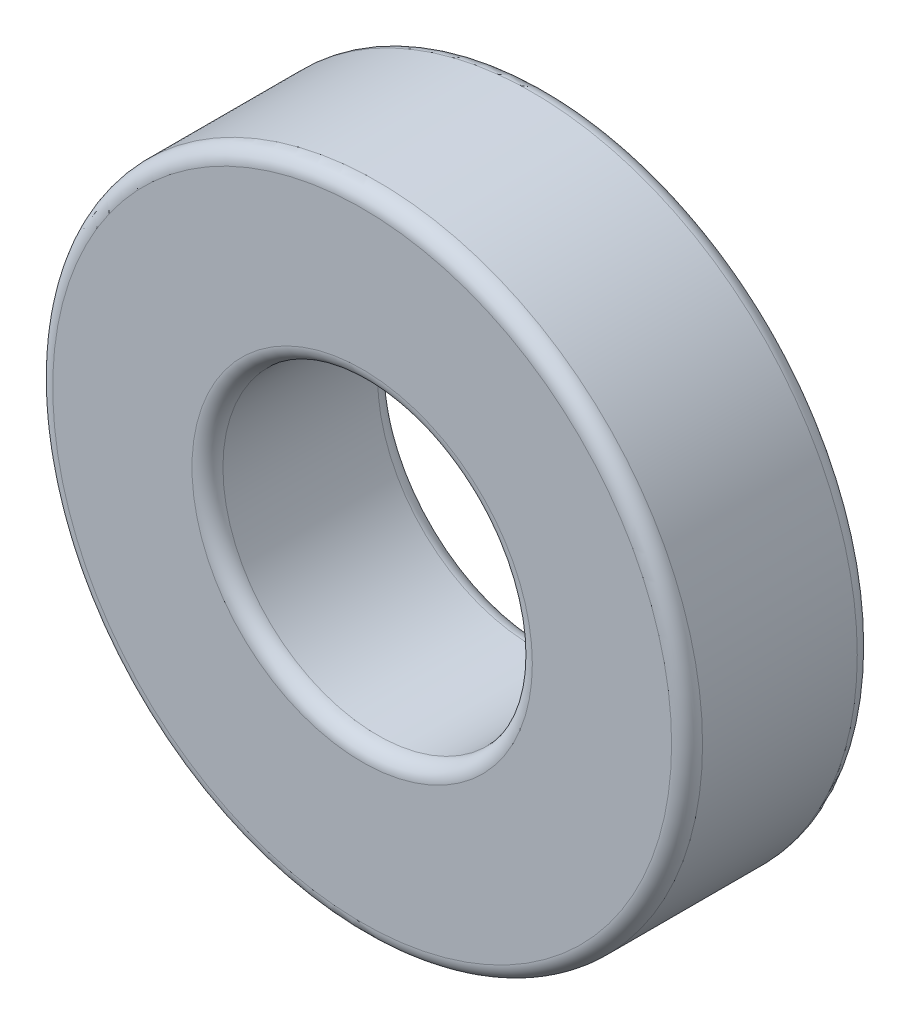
ISO-10303-21;
HEADER;
FILE_DESCRIPTION(('STEP AP214'),'2;1');
FILE_NAME('part.step','',(''),(''),'','','');
FILE_SCHEMA(('AUTOMOTIVE_DESIGN { 1 0 10303 214 1 1 1 1 }'));
ENDSEC;
DATA;
#1=APPLICATION_CONTEXT('core data for automotive mechanical design processes');
#2=APPLICATION_PROTOCOL_DEFINITION('international standard','automotive_design',2000,#1);
#3=PRODUCT_CONTEXT('',#1,'mechanical');
#4=PRODUCT('Part','Part','',(#3));
#5=PRODUCT_RELATED_PRODUCT_CATEGORY('part','',(#4));
#6=PRODUCT_DEFINITION_FORMATION('','',#4);
#7=PRODUCT_DEFINITION_CONTEXT('part definition',#1,'design');
#8=PRODUCT_DEFINITION('design','',#6,#7);
#9=PRODUCT_DEFINITION_SHAPE('','',#8);
#10=(LENGTH_UNIT() NAMED_UNIT(*) SI_UNIT(.MILLI.,.METRE.));
#11=(NAMED_UNIT(*) PLANE_ANGLE_UNIT() SI_UNIT($,.RADIAN.));
#12=(NAMED_UNIT(*) SI_UNIT($,.STERADIAN.) SOLID_ANGLE_UNIT());
#13=UNCERTAINTY_MEASURE_WITH_UNIT(LENGTH_MEASURE(1.E-05),#10,'distance_accuracy_value','');
#14=(GEOMETRIC_REPRESENTATION_CONTEXT(3) GLOBAL_UNCERTAINTY_ASSIGNED_CONTEXT((#13)) GLOBAL_UNIT_ASSIGNED_CONTEXT((#10,
#11,#12)) REPRESENTATION_CONTEXT('',''));
#15=CARTESIAN_POINT('',(0.,0.,0.));
#16=DIRECTION('',(0.,0.,1.));
#17=DIRECTION('',(1.,0.,0.));
#18=AXIS2_PLACEMENT_3D('',#15,#16,#17);
#19=CARTESIAN_POINT('',(0.,0.,12.));
#20=DIRECTION('',(0.,0.,1.));
#21=DIRECTION('',(1.,0.,0.));
#22=AXIS2_PLACEMENT_3D('',#19,#20,#21);
#23=PLANE('',#22);
#24=CARTESIAN_POINT('',(0.,0.,12.));
#25=DIRECTION('',(0.,0.,1.));
#26=DIRECTION('',(1.,0.,0.));
#27=AXIS2_PLACEMENT_3D('',#24,#25,#26);
#28=CIRCLE('',#27,11.);
#29=CARTESIAN_POINT('',(11.,0.,12.));
#30=VERTEX_POINT('',#29);
#31=EDGE_CURVE('E10',#30,#30,#28,.F.);
#32=ORIENTED_EDGE('',*,*,#31,.T.);
#33=EDGE_LOOP('',(#32));
#34=FACE_BOUND('',#33,.T.);
#35=CARTESIAN_POINT('',(0.,0.,12.));
#36=DIRECTION('',(0.,0.,1.));
#37=DIRECTION('',(1.,0.,0.));
#38=AXIS2_PLACEMENT_3D('',#35,#36,#37);
#39=CIRCLE('',#38,20.);
#40=CARTESIAN_POINT('',(20.,0.,12.));
#41=VERTEX_POINT('',#40);
#42=EDGE_CURVE('E38',#41,#41,#39,.T.);
#43=ORIENTED_EDGE('',*,*,#42,.T.);
#44=EDGE_LOOP('',(#43));
#45=FACE_BOUND('',#44,.T.);
#46=ADVANCED_FACE('F31',(#34,#45),#23,.T.);
#47=CARTESIAN_POINT('',(0.,0.,0.));
#48=DIRECTION('',(0.,0.,1.));
#49=DIRECTION('',(1.,0.,0.));
#50=AXIS2_PLACEMENT_3D('',#47,#48,#49);
#51=PLANE('',#50);
#52=CARTESIAN_POINT('',(0.,0.,0.));
#53=DIRECTION('',(0.,0.,1.));
#54=DIRECTION('',(1.,0.,0.));
#55=AXIS2_PLACEMENT_3D('',#52,#53,#54);
#56=CIRCLE('',#55,11.);
#57=CARTESIAN_POINT('',(11.,0.,0.));
#58=VERTEX_POINT('',#57);
#59=EDGE_CURVE('E57',#58,#58,#56,.T.);
#60=ORIENTED_EDGE('',*,*,#59,.T.);
#61=EDGE_LOOP('',(#60));
#62=FACE_BOUND('',#61,.T.);
#63=CARTESIAN_POINT('',(0.,0.,0.));
#64=DIRECTION('',(0.,0.,1.));
#65=DIRECTION('',(1.,0.,0.));
#66=AXIS2_PLACEMENT_3D('',#63,#64,#65);
#67=CIRCLE('',#66,20.);
#68=CARTESIAN_POINT('',(20.,0.,0.));
#69=VERTEX_POINT('',#68);
#70=EDGE_CURVE('E60',#69,#69,#67,.F.);
#71=ORIENTED_EDGE('',*,*,#70,.T.);
#72=EDGE_LOOP('',(#71));
#73=FACE_BOUND('',#72,.T.);
#74=ADVANCED_FACE('F64',(#62,#73),#51,.F.);
#75=CARTESIAN_POINT('',(0.,0.,12.));
#76=DIRECTION('',(0.,0.,-1.));
#77=DIRECTION('',(-1.,0.,0.));
#78=AXIS2_PLACEMENT_3D('',#75,#76,#77);
#79=CYLINDRICAL_SURFACE('',#78,21.);
#80=CARTESIAN_POINT('',(0.,0.,1.));
#81=DIRECTION('',(0.,0.,1.));
#82=DIRECTION('',(1.,0.,0.));
#83=AXIS2_PLACEMENT_3D('',#80,#81,#82);
#84=CIRCLE('',#83,21.);
#85=CARTESIAN_POINT('',(21.,0.,1.));
#86=VERTEX_POINT('',#85);
#87=EDGE_CURVE('E42',#86,#86,#84,.T.);
#88=ORIENTED_EDGE('',*,*,#87,.T.);
#89=EDGE_LOOP('',(#88));
#90=FACE_BOUND('',#89,.T.);
#91=CARTESIAN_POINT('',(0.,0.,11.));
#92=DIRECTION('',(0.,0.,1.));
#93=DIRECTION('',(1.,0.,0.));
#94=AXIS2_PLACEMENT_3D('',#91,#92,#93);
#95=CIRCLE('',#94,21.);
#96=CARTESIAN_POINT('',(21.,0.,11.));
#97=VERTEX_POINT('',#96);
#98=EDGE_CURVE('E46',#97,#97,#95,.F.);
#99=ORIENTED_EDGE('',*,*,#98,.T.);
#100=EDGE_LOOP('',(#99));
#101=FACE_BOUND('',#100,.T.);
#102=ADVANCED_FACE('F74',(#90,#101),#79,.T.);
#103=CARTESIAN_POINT('',(0.,0.,12.));
#104=DIRECTION('',(0.,0.,-1.));
#105=DIRECTION('',(-1.,0.,0.));
#106=AXIS2_PLACEMENT_3D('',#103,#104,#105);
#107=CYLINDRICAL_SURFACE('',#106,10.);
#108=CARTESIAN_POINT('',(0.,0.,1.));
#109=DIRECTION('',(0.,0.,1.));
#110=DIRECTION('',(1.,0.,0.));
#111=AXIS2_PLACEMENT_3D('',#108,#109,#110);
#112=CIRCLE('',#111,10.);
#113=CARTESIAN_POINT('',(10.,0.,1.));
#114=VERTEX_POINT('',#113);
#115=EDGE_CURVE('E51',#114,#114,#112,.F.);
#116=ORIENTED_EDGE('',*,*,#115,.T.);
#117=EDGE_LOOP('',(#116));
#118=FACE_BOUND('',#117,.T.);
#119=CARTESIAN_POINT('',(0.,0.,11.));
#120=DIRECTION('',(0.,0.,1.));
#121=DIRECTION('',(1.,0.,0.));
#122=AXIS2_PLACEMENT_3D('',#119,#120,#121);
#123=CIRCLE('',#122,10.);
#124=CARTESIAN_POINT('',(10.,0.,11.));
#125=VERTEX_POINT('',#124);
#126=EDGE_CURVE('E54',#125,#125,#123,.T.);
#127=ORIENTED_EDGE('',*,*,#126,.T.);
#128=EDGE_LOOP('',(#127));
#129=FACE_BOUND('',#128,.T.);
#130=ADVANCED_FACE('F77',(#118,#129),#107,.F.);
#131=CARTESIAN_POINT('',(0.,0.,1.));
#132=DIRECTION('',(0.,0.,1.));
#133=DIRECTION('',(1.,0.,0.));
#134=AXIS2_PLACEMENT_3D('',#131,#132,#133);
#135=TOROIDAL_SURFACE('',#134,11.,1.);
#136=ORIENTED_EDGE('',*,*,#115,.F.);
#137=EDGE_LOOP('',(#136));
#138=FACE_BOUND('',#137,.T.);
#139=ORIENTED_EDGE('',*,*,#59,.F.);
#140=EDGE_LOOP('',(#139));
#141=FACE_BOUND('',#140,.T.);
#142=ADVANCED_FACE('F70',(#138,#141),#135,.T.);
#143=CARTESIAN_POINT('',(0.,0.,1.));
#144=DIRECTION('',(0.,0.,1.));
#145=DIRECTION('',(1.,0.,0.));
#146=AXIS2_PLACEMENT_3D('',#143,#144,#145);
#147=TOROIDAL_SURFACE('',#146,20.,1.);
#148=ORIENTED_EDGE('',*,*,#70,.F.);
#149=EDGE_LOOP('',(#148));
#150=FACE_BOUND('',#149,.T.);
#151=ORIENTED_EDGE('',*,*,#87,.F.);
#152=EDGE_LOOP('',(#151));
#153=FACE_BOUND('',#152,.T.);
#154=ADVANCED_FACE('F66',(#150,#153),#147,.T.);
#155=CARTESIAN_POINT('',(0.,0.,11.));
#156=DIRECTION('',(0.,0.,1.));
#157=DIRECTION('',(1.,0.,0.));
#158=AXIS2_PLACEMENT_3D('',#155,#156,#157);
#159=TOROIDAL_SURFACE('',#158,11.,1.);
#160=ORIENTED_EDGE('',*,*,#31,.F.);
#161=EDGE_LOOP('',(#160));
#162=FACE_BOUND('',#161,.T.);
#163=ORIENTED_EDGE('',*,*,#126,.F.);
#164=EDGE_LOOP('',(#163));
#165=FACE_BOUND('',#164,.T.);
#166=ADVANCED_FACE('F69',(#162,#165),#159,.T.);
#167=CARTESIAN_POINT('',(0.,0.,11.));
#168=DIRECTION('',(0.,0.,1.));
#169=DIRECTION('',(1.,0.,0.));
#170=AXIS2_PLACEMENT_3D('',#167,#168,#169);
#171=TOROIDAL_SURFACE('',#170,20.,1.);
#172=ORIENTED_EDGE('',*,*,#98,.F.);
#173=EDGE_LOOP('',(#172));
#174=FACE_BOUND('',#173,.T.);
#175=ORIENTED_EDGE('',*,*,#42,.F.);
#176=EDGE_LOOP('',(#175));
#177=FACE_BOUND('',#176,.T.);
#178=ADVANCED_FACE('F33',(#174,#177),#171,.T.);
#179=CLOSED_SHELL('',(#46,#74,#102,#130,#142,#154,#166,#178));
#180=MANIFOLD_SOLID_BREP('B2',#179);
#181=ADVANCED_BREP_SHAPE_REPRESENTATION('',(#18,#180),#14);
#182=SHAPE_DEFINITION_REPRESENTATION(#9,#181);
ENDSEC;
END-ISO-10303-21;
